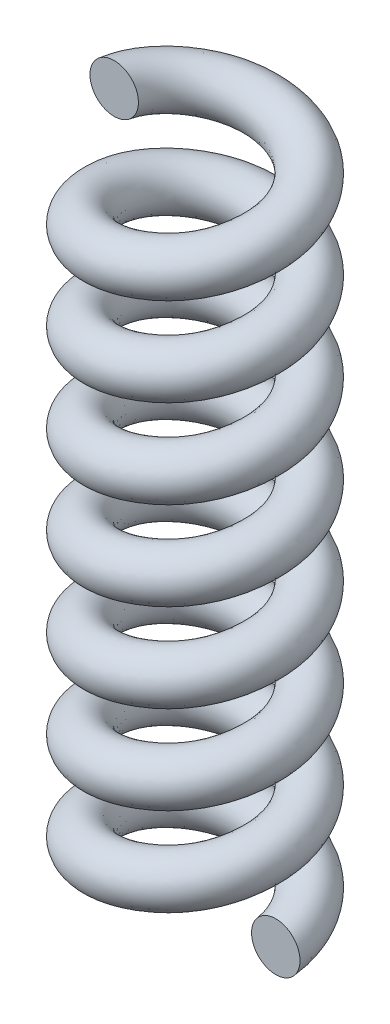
ISO-10303-21;
HEADER;
FILE_DESCRIPTION(('STEP AP214'),'2;1');
FILE_NAME('part.step','',(''),(''),'','','');
FILE_SCHEMA(('AUTOMOTIVE_DESIGN { 1 0 10303 214 1 1 1 1 }'));
ENDSEC;
DATA;
#1=APPLICATION_CONTEXT('core data for automotive mechanical design processes');
#2=APPLICATION_PROTOCOL_DEFINITION('international standard','automotive_design',2000,#1);
#3=PRODUCT_CONTEXT('',#1,'mechanical');
#4=PRODUCT('Part','Part','',(#3));
#5=PRODUCT_RELATED_PRODUCT_CATEGORY('part','',(#4));
#6=PRODUCT_DEFINITION_FORMATION('','',#4);
#7=PRODUCT_DEFINITION_CONTEXT('part definition',#1,'design');
#8=PRODUCT_DEFINITION('design','',#6,#7);
#9=PRODUCT_DEFINITION_SHAPE('','',#8);
#10=(LENGTH_UNIT() NAMED_UNIT(*) SI_UNIT(.MILLI.,.METRE.));
#11=(NAMED_UNIT(*) PLANE_ANGLE_UNIT() SI_UNIT($,.RADIAN.));
#12=(NAMED_UNIT(*) SI_UNIT($,.STERADIAN.) SOLID_ANGLE_UNIT());
#13=UNCERTAINTY_MEASURE_WITH_UNIT(LENGTH_MEASURE(1.E-05),#10,'distance_accuracy_value','');
#14=(GEOMETRIC_REPRESENTATION_CONTEXT(3) GLOBAL_UNCERTAINTY_ASSIGNED_CONTEXT((#13)) GLOBAL_UNIT_ASSIGNED_CONTEXT((#10,
#11,#12)) REPRESENTATION_CONTEXT('',''));
#15=CARTESIAN_POINT('',(0.,0.,0.));
#16=DIRECTION('',(0.,0.,1.));
#17=DIRECTION('',(1.,0.,0.));
#18=AXIS2_PLACEMENT_3D('',#15,#16,#17);
#19=CARTESIAN_POINT('',(-0.750000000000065,6.37500000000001,0.));
#20=DIRECTION('',(-1.01191787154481E-13,0.,-1.));
#21=DIRECTION('',(-1.,0.,1.01191787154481E-13));
#22=AXIS2_PLACEMENT_3D('',#19,#20,#21);
#23=PLANE('',#22);
#24=CARTESIAN_POINT('',(-0.750000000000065,6.37500000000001,0.));
#25=DIRECTION('',(-1.01191787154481E-13,0.,-1.));
#26=DIRECTION('',(-1.,0.,1.01191787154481E-13));
#27=AXIS2_PLACEMENT_3D('',#24,#25,#26);
#28=CIRCLE('',#27,0.225);
#29=CARTESIAN_POINT('',(-0.975000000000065,6.37500000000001,0.));
#30=VERTEX_POINT('',#29);
#31=EDGE_CURVE('E40',#30,#30,#28,.T.);
#32=ORIENTED_EDGE('',*,*,#31,.F.);
#33=EDGE_LOOP('',(#32));
#34=FACE_BOUND('',#33,.T.);
#35=ADVANCED_FACE('F32',(#34),#23,.F.);
#36=CARTESIAN_POINT('',(0.750000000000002,0.225000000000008,0.));
#37=DIRECTION('',(0.,0.,1.));
#38=DIRECTION('',(1.,0.,0.));
#39=AXIS2_PLACEMENT_3D('',#36,#37,#38);
#40=PLANE('',#39);
#41=CARTESIAN_POINT('',(0.750000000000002,0.225000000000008,0.));
#42=DIRECTION('',(0.,0.,1.));
#43=DIRECTION('',(1.,0.,0.));
#44=AXIS2_PLACEMENT_3D('',#41,#42,#43);
#45=CIRCLE('',#44,0.225);
#46=CARTESIAN_POINT('',(0.975000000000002,0.224999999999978,0.));
#47=VERTEX_POINT('',#46);
#48=EDGE_CURVE('E11',#47,#47,#45,.T.);
#49=ORIENTED_EDGE('',*,*,#48,.T.);
#50=EDGE_LOOP('',(#49));
#51=FACE_BOUND('',#50,.T.);
#52=ADVANCED_FACE('F48',(#51),#40,.T.);
#53=CARTESIAN_POINT('',(-0.975000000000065,6.37500000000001,0.));
#54=CARTESIAN_POINT('',(-0.975000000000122,6.30666666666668,-0.562916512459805));
#55=CARTESIAN_POINT('',(-0.487500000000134,6.23833333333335,-0.844374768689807));
#56=CARTESIAN_POINT('',(-1.46064691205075E-13,6.17000000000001,-1.12583302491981));
#57=CARTESIAN_POINT('',(0.487499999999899,6.10166666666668,-0.844374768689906));
#58=CARTESIAN_POINT('',(0.974999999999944,6.03333333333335,-0.562916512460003));
#59=CARTESIAN_POINT('',(0.975000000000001,5.96500000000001,0.));
#60=CARTESIAN_POINT('',(0.975000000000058,5.89666666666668,0.562916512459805));
#61=CARTESIAN_POINT('',(0.48750000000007,5.82833333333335,0.844374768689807));
#62=CARTESIAN_POINT('',(0.,5.76000000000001,1.12583302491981));
#63=CARTESIAN_POINT('',(-0.487499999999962,5.69166666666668,0.844374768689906));
#64=CARTESIAN_POINT('',(-0.975000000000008,5.62333333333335,0.562916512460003));
#65=CARTESIAN_POINT('',(-0.975000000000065,5.55500000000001,0.));
#66=CARTESIAN_POINT('',(-0.975000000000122,5.48666666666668,-0.562916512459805));
#67=CARTESIAN_POINT('',(-0.487500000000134,5.41833333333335,-0.844374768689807));
#68=CARTESIAN_POINT('',(-1.45977955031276E-13,5.35000000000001,-1.12583302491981));
#69=CARTESIAN_POINT('',(0.487499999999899,5.28166666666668,-0.844374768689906));
#70=CARTESIAN_POINT('',(0.974999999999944,5.21333333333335,-0.562916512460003));
#71=CARTESIAN_POINT('',(0.975000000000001,5.14500000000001,0.));
#72=CARTESIAN_POINT('',(0.975000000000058,5.07666666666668,0.562916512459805));
#73=CARTESIAN_POINT('',(0.48750000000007,5.00833333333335,0.844374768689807));
#74=CARTESIAN_POINT('',(0.,4.94000000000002,1.12583302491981));
#75=CARTESIAN_POINT('',(-0.487499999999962,4.87166666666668,0.844374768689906));
#76=CARTESIAN_POINT('',(-0.975000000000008,4.80333333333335,0.562916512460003));
#77=CARTESIAN_POINT('',(-0.975000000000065,4.73500000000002,0.));
#78=CARTESIAN_POINT('',(-0.975000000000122,4.66666666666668,-0.562916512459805));
#79=CARTESIAN_POINT('',(-0.487500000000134,4.59833333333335,-0.844374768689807));
#80=CARTESIAN_POINT('',(-1.45891218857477E-13,4.53000000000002,-1.12583302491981));
#81=CARTESIAN_POINT('',(0.487499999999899,4.46166666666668,-0.844374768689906));
#82=CARTESIAN_POINT('',(0.974999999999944,4.39333333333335,-0.562916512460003));
#83=CARTESIAN_POINT('',(0.975000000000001,4.32500000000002,0.));
#84=CARTESIAN_POINT('',(0.975000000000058,4.25666666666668,0.562916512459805));
#85=CARTESIAN_POINT('',(0.48750000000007,4.18833333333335,0.844374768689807));
#86=CARTESIAN_POINT('',(0.,4.12000000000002,1.12583302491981));
#87=CARTESIAN_POINT('',(-0.487499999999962,4.05166666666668,0.844374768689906));
#88=CARTESIAN_POINT('',(-0.975000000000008,3.98333333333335,0.562916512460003));
#89=CARTESIAN_POINT('',(-0.975000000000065,3.91500000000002,0.));
#90=CARTESIAN_POINT('',(-0.975000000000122,3.84666666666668,-0.562916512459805));
#91=CARTESIAN_POINT('',(-0.487500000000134,3.77833333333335,-0.844374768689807));
#92=CARTESIAN_POINT('',(-1.45804482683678E-13,3.71000000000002,-1.12583302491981));
#93=CARTESIAN_POINT('',(0.487499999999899,3.64166666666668,-0.844374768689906));
#94=CARTESIAN_POINT('',(0.974999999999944,3.57333333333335,-0.562916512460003));
#95=CARTESIAN_POINT('',(0.975000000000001,3.50500000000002,0.));
#96=CARTESIAN_POINT('',(0.975000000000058,3.43666666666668,0.562916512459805));
#97=CARTESIAN_POINT('',(0.487500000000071,3.36833333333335,0.844374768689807));
#98=CARTESIAN_POINT('',(0.,3.30000000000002,1.12583302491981));
#99=CARTESIAN_POINT('',(-0.487499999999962,3.23166666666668,0.844374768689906));
#100=CARTESIAN_POINT('',(-0.975000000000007,3.16333333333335,0.562916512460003));
#101=CARTESIAN_POINT('',(-0.975000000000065,3.09500000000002,0.));
#102=CARTESIAN_POINT('',(-0.975000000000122,3.02666666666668,-0.562916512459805));
#103=CARTESIAN_POINT('',(-0.487500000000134,2.95833333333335,-0.844374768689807));
#104=CARTESIAN_POINT('',(-1.4571774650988E-13,2.89000000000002,-1.12583302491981));
#105=CARTESIAN_POINT('',(0.487499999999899,2.82166666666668,-0.844374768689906));
#106=CARTESIAN_POINT('',(0.974999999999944,2.75333333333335,-0.562916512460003));
#107=CARTESIAN_POINT('',(0.975000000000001,2.68500000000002,0.));
#108=CARTESIAN_POINT('',(0.975000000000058,2.61666666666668,0.562916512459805));
#109=CARTESIAN_POINT('',(0.487500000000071,2.54833333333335,0.844374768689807));
#110=CARTESIAN_POINT('',(0.,2.48000000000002,1.12583302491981));
#111=CARTESIAN_POINT('',(-0.487499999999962,2.41166666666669,0.844374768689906));
#112=CARTESIAN_POINT('',(-0.975000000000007,2.34333333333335,0.562916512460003));
#113=CARTESIAN_POINT('',(-0.975000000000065,2.27500000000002,0.));
#114=CARTESIAN_POINT('',(-0.975000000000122,2.20666666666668,-0.562916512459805));
#115=CARTESIAN_POINT('',(-0.487500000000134,2.13833333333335,-0.844374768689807));
#116=CARTESIAN_POINT('',(-1.45631010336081E-13,2.07000000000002,-1.12583302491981));
#117=CARTESIAN_POINT('',(0.487499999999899,2.00166666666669,-0.844374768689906));
#118=CARTESIAN_POINT('',(0.974999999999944,1.93333333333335,-0.562916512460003));
#119=CARTESIAN_POINT('',(0.975000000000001,1.86500000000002,0.));
#120=CARTESIAN_POINT('',(0.975000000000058,1.79666666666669,0.562916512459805));
#121=CARTESIAN_POINT('',(0.487500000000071,1.72833333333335,0.844374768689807));
#122=CARTESIAN_POINT('',(0.,1.66000000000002,1.12583302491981));
#123=CARTESIAN_POINT('',(-0.487499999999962,1.59166666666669,0.844374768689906));
#124=CARTESIAN_POINT('',(-0.975000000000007,1.52333333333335,0.562916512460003));
#125=CARTESIAN_POINT('',(-0.975000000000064,1.45500000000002,0.));
#126=CARTESIAN_POINT('',(-0.975000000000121,1.38666666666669,-0.562916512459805));
#127=CARTESIAN_POINT('',(-0.487500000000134,1.31833333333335,-0.844374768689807));
#128=CARTESIAN_POINT('',(-1.45544274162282E-13,1.25000000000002,-1.12583302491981));
#129=CARTESIAN_POINT('',(0.487499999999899,1.18166666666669,-0.844374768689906));
#130=CARTESIAN_POINT('',(0.974999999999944,1.11333333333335,-0.562916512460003));
#131=CARTESIAN_POINT('',(0.975000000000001,1.04500000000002,0.));
#132=CARTESIAN_POINT('',(0.975000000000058,0.976666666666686,0.562916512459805));
#133=CARTESIAN_POINT('',(0.487500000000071,0.908333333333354,0.844374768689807));
#134=CARTESIAN_POINT('',(0.,0.84000000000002,1.12583302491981));
#135=CARTESIAN_POINT('',(-0.487499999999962,0.771666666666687,0.844374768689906));
#136=CARTESIAN_POINT('',(-0.975000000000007,0.703333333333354,0.562916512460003));
#137=CARTESIAN_POINT('',(-0.975000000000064,0.63500000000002,0.));
#138=CARTESIAN_POINT('',(-0.975000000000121,0.566666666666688,-0.562916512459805));
#139=CARTESIAN_POINT('',(-0.487500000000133,0.498333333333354,-0.844374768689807));
#140=CARTESIAN_POINT('',(-1.45457537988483E-13,0.430000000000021,-1.12583302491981));
#141=CARTESIAN_POINT('',(0.487499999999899,0.361666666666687,-0.844374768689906));
#142=CARTESIAN_POINT('',(0.974999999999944,0.293333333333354,-0.562916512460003));
#143=CARTESIAN_POINT('',(0.975000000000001,0.225000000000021,0.));
#144=CARTESIAN_POINT('',(0.975000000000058,0.156666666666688,0.562916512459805));
#145=CARTESIAN_POINT('',(0.487500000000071,0.0883333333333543,0.844374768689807));
#146=CARTESIAN_POINT('',(0.,0.0200000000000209,1.12583302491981));
#147=CARTESIAN_POINT('',(-0.487499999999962,-0.0483333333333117,0.844374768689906));
#148=CARTESIAN_POINT('',(-0.975000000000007,-0.116666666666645,0.562916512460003));
#149=CARTESIAN_POINT('',(-0.975000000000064,-0.184999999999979,0.));
#150=CARTESIAN_POINT('',(-0.975000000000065,6.82500000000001,0.));
#151=CARTESIAN_POINT('',(-0.975000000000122,6.75666666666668,-0.562916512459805));
#152=CARTESIAN_POINT('',(-0.487500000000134,6.68833333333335,-0.844374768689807));
#153=CARTESIAN_POINT('',(-1.46112290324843E-13,6.62000000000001,-1.12583302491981));
#154=CARTESIAN_POINT('',(0.487499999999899,6.55166666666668,-0.844374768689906));
#155=CARTESIAN_POINT('',(0.974999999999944,6.48333333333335,-0.562916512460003));
#156=CARTESIAN_POINT('',(0.975000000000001,6.41500000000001,0.));
#157=CARTESIAN_POINT('',(0.975000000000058,6.34666666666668,0.562916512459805));
#158=CARTESIAN_POINT('',(0.48750000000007,6.27833333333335,0.844374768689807));
#159=CARTESIAN_POINT('',(0.,6.21000000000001,1.12583302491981));
#160=CARTESIAN_POINT('',(-0.487499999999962,6.14166666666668,0.844374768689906));
#161=CARTESIAN_POINT('',(-0.975000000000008,6.07333333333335,0.562916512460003));
#162=CARTESIAN_POINT('',(-0.975000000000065,6.00500000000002,0.));
#163=CARTESIAN_POINT('',(-0.975000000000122,5.93666666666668,-0.562916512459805));
#164=CARTESIAN_POINT('',(-0.487500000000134,5.86833333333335,-0.844374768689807));
#165=CARTESIAN_POINT('',(-1.46025554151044E-13,5.80000000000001,-1.12583302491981));
#166=CARTESIAN_POINT('',(0.487499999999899,5.73166666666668,-0.844374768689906));
#167=CARTESIAN_POINT('',(0.974999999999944,5.66333333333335,-0.562916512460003));
#168=CARTESIAN_POINT('',(0.975000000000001,5.59500000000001,0.));
#169=CARTESIAN_POINT('',(0.975000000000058,5.52666666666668,0.562916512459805));
#170=CARTESIAN_POINT('',(0.48750000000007,5.45833333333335,0.844374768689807));
#171=CARTESIAN_POINT('',(0.,5.39000000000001,1.12583302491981));
#172=CARTESIAN_POINT('',(-0.487499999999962,5.32166666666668,0.844374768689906));
#173=CARTESIAN_POINT('',(-0.975000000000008,5.25333333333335,0.562916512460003));
#174=CARTESIAN_POINT('',(-0.975000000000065,5.18500000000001,0.));
#175=CARTESIAN_POINT('',(-0.975000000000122,5.11666666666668,-0.562916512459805));
#176=CARTESIAN_POINT('',(-0.487500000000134,5.04833333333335,-0.844374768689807));
#177=CARTESIAN_POINT('',(-1.45938817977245E-13,4.98000000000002,-1.12583302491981));
#178=CARTESIAN_POINT('',(0.487499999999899,4.91166666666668,-0.844374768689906));
#179=CARTESIAN_POINT('',(0.974999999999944,4.84333333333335,-0.562916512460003));
#180=CARTESIAN_POINT('',(0.975000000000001,4.77500000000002,0.));
#181=CARTESIAN_POINT('',(0.975000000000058,4.70666666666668,0.562916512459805));
#182=CARTESIAN_POINT('',(0.48750000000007,4.63833333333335,0.844374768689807));
#183=CARTESIAN_POINT('',(0.,4.57000000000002,1.12583302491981));
#184=CARTESIAN_POINT('',(-0.487499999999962,4.50166666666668,0.844374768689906));
#185=CARTESIAN_POINT('',(-0.975000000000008,4.43333333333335,0.562916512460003));
#186=CARTESIAN_POINT('',(-0.975000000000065,4.36500000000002,0.));
#187=CARTESIAN_POINT('',(-0.975000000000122,4.29666666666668,-0.562916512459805));
#188=CARTESIAN_POINT('',(-0.487500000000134,4.22833333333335,-0.844374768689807));
#189=CARTESIAN_POINT('',(-1.45852081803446E-13,4.16000000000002,-1.12583302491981));
#190=CARTESIAN_POINT('',(0.487499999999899,4.09166666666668,-0.844374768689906));
#191=CARTESIAN_POINT('',(0.974999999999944,4.02333333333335,-0.562916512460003));
#192=CARTESIAN_POINT('',(0.975000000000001,3.95500000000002,0.));
#193=CARTESIAN_POINT('',(0.975000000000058,3.88666666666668,0.562916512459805));
#194=CARTESIAN_POINT('',(0.48750000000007,3.81833333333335,0.844374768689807));
#195=CARTESIAN_POINT('',(0.,3.75000000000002,1.12583302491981));
#196=CARTESIAN_POINT('',(-0.487499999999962,3.68166666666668,0.844374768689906));
#197=CARTESIAN_POINT('',(-0.975000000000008,3.61333333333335,0.562916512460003));
#198=CARTESIAN_POINT('',(-0.975000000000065,3.54500000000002,0.));
#199=CARTESIAN_POINT('',(-0.975000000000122,3.47666666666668,-0.562916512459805));
#200=CARTESIAN_POINT('',(-0.487500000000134,3.40833333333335,-0.844374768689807));
#201=CARTESIAN_POINT('',(-1.45765345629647E-13,3.34000000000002,-1.12583302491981));
#202=CARTESIAN_POINT('',(0.487499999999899,3.27166666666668,-0.844374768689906));
#203=CARTESIAN_POINT('',(0.974999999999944,3.20333333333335,-0.562916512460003));
#204=CARTESIAN_POINT('',(0.975000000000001,3.13500000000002,0.));
#205=CARTESIAN_POINT('',(0.975000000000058,3.06666666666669,0.562916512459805));
#206=CARTESIAN_POINT('',(0.487500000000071,2.99833333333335,0.844374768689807));
#207=CARTESIAN_POINT('',(0.,2.93000000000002,1.12583302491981));
#208=CARTESIAN_POINT('',(-0.487499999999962,2.86166666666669,0.844374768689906));
#209=CARTESIAN_POINT('',(-0.975000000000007,2.79333333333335,0.562916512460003));
#210=CARTESIAN_POINT('',(-0.975000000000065,2.72500000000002,0.));
#211=CARTESIAN_POINT('',(-0.975000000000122,2.65666666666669,-0.562916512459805));
#212=CARTESIAN_POINT('',(-0.487500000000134,2.58833333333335,-0.844374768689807));
#213=CARTESIAN_POINT('',(-1.45678609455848E-13,2.52000000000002,-1.12583302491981));
#214=CARTESIAN_POINT('',(0.487499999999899,2.45166666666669,-0.844374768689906));
#215=CARTESIAN_POINT('',(0.974999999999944,2.38333333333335,-0.562916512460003));
#216=CARTESIAN_POINT('',(0.975000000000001,2.31500000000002,0.));
#217=CARTESIAN_POINT('',(0.975000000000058,2.24666666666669,0.562916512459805));
#218=CARTESIAN_POINT('',(0.487500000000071,2.17833333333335,0.844374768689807));
#219=CARTESIAN_POINT('',(0.,2.11000000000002,1.12583302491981));
#220=CARTESIAN_POINT('',(-0.487499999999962,2.04166666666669,0.844374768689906));
#221=CARTESIAN_POINT('',(-0.975000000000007,1.97333333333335,0.562916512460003));
#222=CARTESIAN_POINT('',(-0.975000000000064,1.90500000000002,0.));
#223=CARTESIAN_POINT('',(-0.975000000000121,1.83666666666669,-0.562916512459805));
#224=CARTESIAN_POINT('',(-0.487500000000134,1.76833333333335,-0.844374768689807));
#225=CARTESIAN_POINT('',(-1.4559187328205E-13,1.70000000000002,-1.12583302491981));
#226=CARTESIAN_POINT('',(0.487499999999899,1.63166666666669,-0.844374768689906));
#227=CARTESIAN_POINT('',(0.974999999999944,1.56333333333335,-0.562916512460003));
#228=CARTESIAN_POINT('',(0.975000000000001,1.49500000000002,0.));
#229=CARTESIAN_POINT('',(0.975000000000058,1.42666666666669,0.562916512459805));
#230=CARTESIAN_POINT('',(0.487500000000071,1.35833333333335,0.844374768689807));
#231=CARTESIAN_POINT('',(0.,1.29000000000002,1.12583302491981));
#232=CARTESIAN_POINT('',(-0.487499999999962,1.22166666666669,0.844374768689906));
#233=CARTESIAN_POINT('',(-0.975000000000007,1.15333333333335,0.562916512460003));
#234=CARTESIAN_POINT('',(-0.975000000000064,1.08500000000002,0.));
#235=CARTESIAN_POINT('',(-0.975000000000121,1.01666666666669,-0.562916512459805));
#236=CARTESIAN_POINT('',(-0.487500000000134,0.948333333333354,-0.844374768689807));
#237=CARTESIAN_POINT('',(-1.45505137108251E-13,0.880000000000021,-1.12583302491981));
#238=CARTESIAN_POINT('',(0.487499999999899,0.811666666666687,-0.844374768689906));
#239=CARTESIAN_POINT('',(0.974999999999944,0.743333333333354,-0.562916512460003));
#240=CARTESIAN_POINT('',(0.975000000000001,0.675000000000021,0.));
#241=CARTESIAN_POINT('',(0.975000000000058,0.606666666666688,0.562916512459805));
#242=CARTESIAN_POINT('',(0.487500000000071,0.538333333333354,0.844374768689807));
#243=CARTESIAN_POINT('',(0.,0.470000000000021,1.12583302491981));
#244=CARTESIAN_POINT('',(-0.487499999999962,0.401666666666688,0.844374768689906));
#245=CARTESIAN_POINT('',(-0.975000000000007,0.333333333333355,0.562916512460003));
#246=CARTESIAN_POINT('',(-0.975000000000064,0.265000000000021,0.));
#247=CARTESIAN_POINT('',(-0.525000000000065,6.82500000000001,0.));
#248=CARTESIAN_POINT('',(-0.525000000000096,6.75666666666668,-0.303108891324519));
#249=CARTESIAN_POINT('',(-0.262500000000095,6.68833333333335,-0.454663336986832));
#250=CARTESIAN_POINT('',(0.,6.62000000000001,-0.606217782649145));
#251=CARTESIAN_POINT('',(0.262499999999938,6.55166666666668,-0.454663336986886));
#252=CARTESIAN_POINT('',(0.52499999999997,6.48333333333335,-0.303108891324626));
#253=CARTESIAN_POINT('',(0.525000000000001,6.41500000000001,0.));
#254=CARTESIAN_POINT('',(0.525000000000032,6.34666666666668,0.303108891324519));
#255=CARTESIAN_POINT('',(0.262500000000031,6.27833333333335,0.454663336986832));
#256=CARTESIAN_POINT('',(0.,6.21000000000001,0.606217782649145));
#257=CARTESIAN_POINT('',(-0.262500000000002,6.14166666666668,0.454663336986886));
#258=CARTESIAN_POINT('',(-0.525000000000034,6.07333333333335,0.303108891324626));
#259=CARTESIAN_POINT('',(-0.525000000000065,6.00500000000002,0.));
#260=CARTESIAN_POINT('',(-0.525000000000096,5.93666666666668,-0.303108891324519));
#261=CARTESIAN_POINT('',(-0.262500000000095,5.86833333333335,-0.454663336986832));
#262=CARTESIAN_POINT('',(0.,5.80000000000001,-0.606217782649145));
#263=CARTESIAN_POINT('',(0.262499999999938,5.73166666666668,-0.454663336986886));
#264=CARTESIAN_POINT('',(0.52499999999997,5.66333333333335,-0.303108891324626));
#265=CARTESIAN_POINT('',(0.525000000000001,5.59500000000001,0.));
#266=CARTESIAN_POINT('',(0.525000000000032,5.52666666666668,0.303108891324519));
#267=CARTESIAN_POINT('',(0.262500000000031,5.45833333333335,0.454663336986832));
#268=CARTESIAN_POINT('',(0.,5.39000000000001,0.606217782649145));
#269=CARTESIAN_POINT('',(-0.262500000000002,5.32166666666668,0.454663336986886));
#270=CARTESIAN_POINT('',(-0.525000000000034,5.25333333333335,0.303108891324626));
#271=CARTESIAN_POINT('',(-0.525000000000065,5.18500000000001,0.));
#272=CARTESIAN_POINT('',(-0.525000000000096,5.11666666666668,-0.303108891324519));
#273=CARTESIAN_POINT('',(-0.262500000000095,5.04833333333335,-0.454663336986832));
#274=CARTESIAN_POINT('',(0.,4.98000000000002,-0.606217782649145));
#275=CARTESIAN_POINT('',(0.262499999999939,4.91166666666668,-0.454663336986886));
#276=CARTESIAN_POINT('',(0.52499999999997,4.84333333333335,-0.303108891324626));
#277=CARTESIAN_POINT('',(0.525000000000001,4.77500000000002,0.));
#278=CARTESIAN_POINT('',(0.525000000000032,4.70666666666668,0.303108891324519));
#279=CARTESIAN_POINT('',(0.262500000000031,4.63833333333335,0.454663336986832));
#280=CARTESIAN_POINT('',(0.,4.57000000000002,0.606217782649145));
#281=CARTESIAN_POINT('',(-0.262500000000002,4.50166666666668,0.454663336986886));
#282=CARTESIAN_POINT('',(-0.525000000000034,4.43333333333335,0.303108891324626));
#283=CARTESIAN_POINT('',(-0.525000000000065,4.36500000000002,0.));
#284=CARTESIAN_POINT('',(-0.525000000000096,4.29666666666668,-0.303108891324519));
#285=CARTESIAN_POINT('',(-0.262500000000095,4.22833333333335,-0.454663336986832));
#286=CARTESIAN_POINT('',(0.,4.16000000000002,-0.606217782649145));
#287=CARTESIAN_POINT('',(0.262499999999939,4.09166666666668,-0.454663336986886));
#288=CARTESIAN_POINT('',(0.52499999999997,4.02333333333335,-0.303108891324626));
#289=CARTESIAN_POINT('',(0.525000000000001,3.95500000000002,0.));
#290=CARTESIAN_POINT('',(0.525000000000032,3.88666666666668,0.303108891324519));
#291=CARTESIAN_POINT('',(0.262500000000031,3.81833333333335,0.454663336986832));
#292=CARTESIAN_POINT('',(0.,3.75000000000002,0.606217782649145));
#293=CARTESIAN_POINT('',(-0.262500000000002,3.68166666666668,0.454663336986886));
#294=CARTESIAN_POINT('',(-0.525000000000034,3.61333333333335,0.303108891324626));
#295=CARTESIAN_POINT('',(-0.525000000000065,3.54500000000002,0.));
#296=CARTESIAN_POINT('',(-0.525000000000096,3.47666666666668,-0.303108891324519));
#297=CARTESIAN_POINT('',(-0.262500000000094,3.40833333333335,-0.454663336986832));
#298=CARTESIAN_POINT('',(0.,3.34000000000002,-0.606217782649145));
#299=CARTESIAN_POINT('',(0.262499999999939,3.27166666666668,-0.454663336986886));
#300=CARTESIAN_POINT('',(0.524999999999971,3.20333333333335,-0.303108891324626));
#301=CARTESIAN_POINT('',(0.525000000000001,3.13500000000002,0.));
#302=CARTESIAN_POINT('',(0.525000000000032,3.06666666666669,0.303108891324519));
#303=CARTESIAN_POINT('',(0.262500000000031,2.99833333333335,0.454663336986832));
#304=CARTESIAN_POINT('',(0.,2.93000000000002,0.606217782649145));
#305=CARTESIAN_POINT('',(-0.262500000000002,2.86166666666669,0.454663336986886));
#306=CARTESIAN_POINT('',(-0.525000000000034,2.79333333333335,0.303108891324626));
#307=CARTESIAN_POINT('',(-0.525000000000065,2.72500000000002,0.));
#308=CARTESIAN_POINT('',(-0.525000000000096,2.65666666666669,-0.303108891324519));
#309=CARTESIAN_POINT('',(-0.262500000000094,2.58833333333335,-0.454663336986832));
#310=CARTESIAN_POINT('',(0.,2.52000000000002,-0.606217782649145));
#311=CARTESIAN_POINT('',(0.262499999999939,2.45166666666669,-0.454663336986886));
#312=CARTESIAN_POINT('',(0.524999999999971,2.38333333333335,-0.303108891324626));
#313=CARTESIAN_POINT('',(0.525000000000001,2.31500000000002,0.));
#314=CARTESIAN_POINT('',(0.525000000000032,2.24666666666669,0.303108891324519));
#315=CARTESIAN_POINT('',(0.262500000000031,2.17833333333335,0.454663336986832));
#316=CARTESIAN_POINT('',(0.,2.11000000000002,0.606217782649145));
#317=CARTESIAN_POINT('',(-0.262500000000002,2.04166666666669,0.454663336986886));
#318=CARTESIAN_POINT('',(-0.525000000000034,1.97333333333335,0.303108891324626));
#319=CARTESIAN_POINT('',(-0.525000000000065,1.90500000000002,0.));
#320=CARTESIAN_POINT('',(-0.525000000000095,1.83666666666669,-0.303108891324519));
#321=CARTESIAN_POINT('',(-0.262500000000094,1.76833333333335,-0.454663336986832));
#322=CARTESIAN_POINT('',(0.,1.70000000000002,-0.606217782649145));
#323=CARTESIAN_POINT('',(0.262499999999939,1.63166666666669,-0.454663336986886));
#324=CARTESIAN_POINT('',(0.524999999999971,1.56333333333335,-0.303108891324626));
#325=CARTESIAN_POINT('',(0.525000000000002,1.49500000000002,0.));
#326=CARTESIAN_POINT('',(0.525000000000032,1.42666666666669,0.303108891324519));
#327=CARTESIAN_POINT('',(0.262500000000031,1.35833333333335,0.454663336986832));
#328=CARTESIAN_POINT('',(0.,1.29000000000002,0.606217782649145));
#329=CARTESIAN_POINT('',(-0.262500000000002,1.22166666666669,0.454663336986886));
#330=CARTESIAN_POINT('',(-0.525000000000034,1.15333333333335,0.303108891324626));
#331=CARTESIAN_POINT('',(-0.525000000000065,1.08500000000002,0.));
#332=CARTESIAN_POINT('',(-0.525000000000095,1.01666666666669,-0.303108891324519));
#333=CARTESIAN_POINT('',(-0.262500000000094,0.948333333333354,-0.454663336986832));
#334=CARTESIAN_POINT('',(0.,0.880000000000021,-0.606217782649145));
#335=CARTESIAN_POINT('',(0.262499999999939,0.811666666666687,-0.454663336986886));
#336=CARTESIAN_POINT('',(0.524999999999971,0.743333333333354,-0.303108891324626));
#337=CARTESIAN_POINT('',(0.525000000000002,0.675000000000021,0.));
#338=CARTESIAN_POINT('',(0.525000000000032,0.606666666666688,0.303108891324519));
#339=CARTESIAN_POINT('',(0.262500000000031,0.538333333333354,0.454663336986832));
#340=CARTESIAN_POINT('',(0.,0.470000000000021,0.606217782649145));
#341=CARTESIAN_POINT('',(-0.262500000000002,0.401666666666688,0.454663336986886));
#342=CARTESIAN_POINT('',(-0.525000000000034,0.333333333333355,0.303108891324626));
#343=CARTESIAN_POINT('',(-0.525000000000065,0.265000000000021,0.));
#344=CARTESIAN_POINT('',(-0.525000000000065,6.37500000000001,0.));
#345=CARTESIAN_POINT('',(-0.525000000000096,6.30666666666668,-0.303108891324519));
#346=CARTESIAN_POINT('',(-0.262500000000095,6.23833333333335,-0.454663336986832));
#347=CARTESIAN_POINT('',(0.,6.17000000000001,-0.606217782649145));
#348=CARTESIAN_POINT('',(0.262499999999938,6.10166666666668,-0.454663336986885));
#349=CARTESIAN_POINT('',(0.52499999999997,6.03333333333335,-0.303108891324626));
#350=CARTESIAN_POINT('',(0.525000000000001,5.96500000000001,0.));
#351=CARTESIAN_POINT('',(0.525000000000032,5.89666666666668,0.303108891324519));
#352=CARTESIAN_POINT('',(0.262500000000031,5.82833333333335,0.454663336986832));
#353=CARTESIAN_POINT('',(0.,5.76000000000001,0.606217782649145));
#354=CARTESIAN_POINT('',(-0.262500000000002,5.69166666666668,0.454663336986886));
#355=CARTESIAN_POINT('',(-0.525000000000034,5.62333333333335,0.303108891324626));
#356=CARTESIAN_POINT('',(-0.525000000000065,5.55500000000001,0.));
#357=CARTESIAN_POINT('',(-0.525000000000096,5.48666666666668,-0.303108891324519));
#358=CARTESIAN_POINT('',(-0.262500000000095,5.41833333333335,-0.454663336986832));
#359=CARTESIAN_POINT('',(0.,5.35000000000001,-0.606217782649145));
#360=CARTESIAN_POINT('',(0.262499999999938,5.28166666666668,-0.454663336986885));
#361=CARTESIAN_POINT('',(0.52499999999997,5.21333333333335,-0.303108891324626));
#362=CARTESIAN_POINT('',(0.525000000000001,5.14500000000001,0.));
#363=CARTESIAN_POINT('',(0.525000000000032,5.07666666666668,0.303108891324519));
#364=CARTESIAN_POINT('',(0.262500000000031,5.00833333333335,0.454663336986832));
#365=CARTESIAN_POINT('',(0.,4.94000000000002,0.606217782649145));
#366=CARTESIAN_POINT('',(-0.262500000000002,4.87166666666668,0.454663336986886));
#367=CARTESIAN_POINT('',(-0.525000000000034,4.80333333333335,0.303108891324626));
#368=CARTESIAN_POINT('',(-0.525000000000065,4.73500000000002,0.));
#369=CARTESIAN_POINT('',(-0.525000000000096,4.66666666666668,-0.303108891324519));
#370=CARTESIAN_POINT('',(-0.262500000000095,4.59833333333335,-0.454663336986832));
#371=CARTESIAN_POINT('',(0.,4.53000000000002,-0.606217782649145));
#372=CARTESIAN_POINT('',(0.262499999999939,4.46166666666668,-0.454663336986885));
#373=CARTESIAN_POINT('',(0.52499999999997,4.39333333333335,-0.303108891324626));
#374=CARTESIAN_POINT('',(0.525000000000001,4.32500000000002,0.));
#375=CARTESIAN_POINT('',(0.525000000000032,4.25666666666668,0.303108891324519));
#376=CARTESIAN_POINT('',(0.262500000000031,4.18833333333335,0.454663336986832));
#377=CARTESIAN_POINT('',(0.,4.12000000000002,0.606217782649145));
#378=CARTESIAN_POINT('',(-0.262500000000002,4.05166666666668,0.454663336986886));
#379=CARTESIAN_POINT('',(-0.525000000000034,3.98333333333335,0.303108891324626));
#380=CARTESIAN_POINT('',(-0.525000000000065,3.91500000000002,0.));
#381=CARTESIAN_POINT('',(-0.525000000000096,3.84666666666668,-0.303108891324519));
#382=CARTESIAN_POINT('',(-0.262500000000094,3.77833333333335,-0.454663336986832));
#383=CARTESIAN_POINT('',(0.,3.71000000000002,-0.606217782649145));
#384=CARTESIAN_POINT('',(0.262499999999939,3.64166666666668,-0.454663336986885));
#385=CARTESIAN_POINT('',(0.52499999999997,3.57333333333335,-0.303108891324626));
#386=CARTESIAN_POINT('',(0.525000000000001,3.50500000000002,0.));
#387=CARTESIAN_POINT('',(0.525000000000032,3.43666666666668,0.303108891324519));
#388=CARTESIAN_POINT('',(0.262500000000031,3.36833333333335,0.454663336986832));
#389=CARTESIAN_POINT('',(0.,3.30000000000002,0.606217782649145));
#390=CARTESIAN_POINT('',(-0.262500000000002,3.23166666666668,0.454663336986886));
#391=CARTESIAN_POINT('',(-0.525000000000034,3.16333333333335,0.303108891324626));
#392=CARTESIAN_POINT('',(-0.525000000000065,3.09500000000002,0.));
#393=CARTESIAN_POINT('',(-0.525000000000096,3.02666666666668,-0.303108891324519));
#394=CARTESIAN_POINT('',(-0.262500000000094,2.95833333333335,-0.454663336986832));
#395=CARTESIAN_POINT('',(0.,2.89000000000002,-0.606217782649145));
#396=CARTESIAN_POINT('',(0.262499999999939,2.82166666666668,-0.454663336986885));
#397=CARTESIAN_POINT('',(0.52499999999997,2.75333333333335,-0.303108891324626));
#398=CARTESIAN_POINT('',(0.525000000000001,2.68500000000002,0.));
#399=CARTESIAN_POINT('',(0.525000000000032,2.61666666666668,0.303108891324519));
#400=CARTESIAN_POINT('',(0.262500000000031,2.54833333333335,0.454663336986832));
#401=CARTESIAN_POINT('',(0.,2.48000000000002,0.606217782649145));
#402=CARTESIAN_POINT('',(-0.262500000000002,2.41166666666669,0.454663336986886));
#403=CARTESIAN_POINT('',(-0.525000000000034,2.34333333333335,0.303108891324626));
#404=CARTESIAN_POINT('',(-0.525000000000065,2.27500000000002,0.));
#405=CARTESIAN_POINT('',(-0.525000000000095,2.20666666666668,-0.303108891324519));
#406=CARTESIAN_POINT('',(-0.262500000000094,2.13833333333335,-0.454663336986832));
#407=CARTESIAN_POINT('',(0.,2.07000000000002,-0.606217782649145));
#408=CARTESIAN_POINT('',(0.262499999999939,2.00166666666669,-0.454663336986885));
#409=CARTESIAN_POINT('',(0.52499999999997,1.93333333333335,-0.303108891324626));
#410=CARTESIAN_POINT('',(0.525000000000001,1.86500000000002,0.));
#411=CARTESIAN_POINT('',(0.525000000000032,1.79666666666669,0.303108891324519));
#412=CARTESIAN_POINT('',(0.262500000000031,1.72833333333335,0.454663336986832));
#413=CARTESIAN_POINT('',(0.,1.66000000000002,0.606217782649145));
#414=CARTESIAN_POINT('',(-0.262500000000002,1.59166666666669,0.454663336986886));
#415=CARTESIAN_POINT('',(-0.525000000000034,1.52333333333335,0.303108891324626));
#416=CARTESIAN_POINT('',(-0.525000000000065,1.45500000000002,0.));
#417=CARTESIAN_POINT('',(-0.525000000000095,1.38666666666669,-0.303108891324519));
#418=CARTESIAN_POINT('',(-0.262500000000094,1.31833333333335,-0.454663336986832));
#419=CARTESIAN_POINT('',(0.,1.25000000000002,-0.606217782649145));
#420=CARTESIAN_POINT('',(0.262499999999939,1.18166666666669,-0.454663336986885));
#421=CARTESIAN_POINT('',(0.524999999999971,1.11333333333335,-0.303108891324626));
#422=CARTESIAN_POINT('',(0.525000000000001,1.04500000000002,0.));
#423=CARTESIAN_POINT('',(0.525000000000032,0.976666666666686,0.303108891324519));
#424=CARTESIAN_POINT('',(0.262500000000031,0.908333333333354,0.454663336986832));
#425=CARTESIAN_POINT('',(0.,0.84000000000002,0.606217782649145));
#426=CARTESIAN_POINT('',(-0.262500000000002,0.771666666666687,0.454663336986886));
#427=CARTESIAN_POINT('',(-0.525000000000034,0.703333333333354,0.303108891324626));
#428=CARTESIAN_POINT('',(-0.525000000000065,0.63500000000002,0.));
#429=CARTESIAN_POINT('',(-0.525000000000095,0.566666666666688,-0.303108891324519));
#430=CARTESIAN_POINT('',(-0.262500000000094,0.498333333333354,-0.454663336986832));
#431=CARTESIAN_POINT('',(0.,0.430000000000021,-0.606217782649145));
#432=CARTESIAN_POINT('',(0.262499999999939,0.361666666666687,-0.454663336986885));
#433=CARTESIAN_POINT('',(0.524999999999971,0.293333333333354,-0.303108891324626));
#434=CARTESIAN_POINT('',(0.525000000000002,0.225000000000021,0.));
#435=CARTESIAN_POINT('',(0.525000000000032,0.156666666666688,0.303108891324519));
#436=CARTESIAN_POINT('',(0.262500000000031,0.0883333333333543,0.454663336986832));
#437=CARTESIAN_POINT('',(0.,0.0200000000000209,0.606217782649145));
#438=CARTESIAN_POINT('',(-0.262500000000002,-0.0483333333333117,0.454663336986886));
#439=CARTESIAN_POINT('',(-0.525000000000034,-0.116666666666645,0.303108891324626));
#440=CARTESIAN_POINT('',(-0.525000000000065,-0.184999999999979,0.));
#441=CARTESIAN_POINT('',(-0.525000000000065,5.92500000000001,0.));
#442=CARTESIAN_POINT('',(-0.525000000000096,5.85666666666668,-0.303108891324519));
#443=CARTESIAN_POINT('',(-0.262500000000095,5.78833333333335,-0.454663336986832));
#444=CARTESIAN_POINT('',(0.,5.72000000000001,-0.606217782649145));
#445=CARTESIAN_POINT('',(0.262499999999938,5.65166666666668,-0.454663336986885));
#446=CARTESIAN_POINT('',(0.52499999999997,5.58333333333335,-0.303108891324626));
#447=CARTESIAN_POINT('',(0.525000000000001,5.51500000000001,0.));
#448=CARTESIAN_POINT('',(0.525000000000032,5.44666666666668,0.303108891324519));
#449=CARTESIAN_POINT('',(0.262500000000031,5.37833333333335,0.454663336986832));
#450=CARTESIAN_POINT('',(0.,5.31000000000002,0.606217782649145));
#451=CARTESIAN_POINT('',(-0.262500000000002,5.24166666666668,0.454663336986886));
#452=CARTESIAN_POINT('',(-0.525000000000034,5.17333333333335,0.303108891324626));
#453=CARTESIAN_POINT('',(-0.525000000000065,5.10500000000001,0.));
#454=CARTESIAN_POINT('',(-0.525000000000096,5.03666666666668,-0.303108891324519));
#455=CARTESIAN_POINT('',(-0.262500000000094,4.96833333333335,-0.454663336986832));
#456=CARTESIAN_POINT('',(0.,4.90000000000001,-0.606217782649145));
#457=CARTESIAN_POINT('',(0.262499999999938,4.83166666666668,-0.454663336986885));
#458=CARTESIAN_POINT('',(0.52499999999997,4.76333333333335,-0.303108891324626));
#459=CARTESIAN_POINT('',(0.525000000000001,4.69500000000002,0.));
#460=CARTESIAN_POINT('',(0.525000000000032,4.62666666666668,0.303108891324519));
#461=CARTESIAN_POINT('',(0.262500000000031,4.55833333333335,0.454663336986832));
#462=CARTESIAN_POINT('',(0.,4.49000000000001,0.606217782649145));
#463=CARTESIAN_POINT('',(-0.262500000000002,4.42166666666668,0.454663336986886));
#464=CARTESIAN_POINT('',(-0.525000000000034,4.35333333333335,0.303108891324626));
#465=CARTESIAN_POINT('',(-0.525000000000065,4.28500000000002,0.));
#466=CARTESIAN_POINT('',(-0.525000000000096,4.21666666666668,-0.303108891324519));
#467=CARTESIAN_POINT('',(-0.262500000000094,4.14833333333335,-0.454663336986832));
#468=CARTESIAN_POINT('',(0.,4.08000000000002,-0.606217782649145));
#469=CARTESIAN_POINT('',(0.262499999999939,4.01166666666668,-0.454663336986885));
#470=CARTESIAN_POINT('',(0.52499999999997,3.94333333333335,-0.303108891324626));
#471=CARTESIAN_POINT('',(0.525000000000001,3.87500000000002,0.));
#472=CARTESIAN_POINT('',(0.525000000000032,3.80666666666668,0.303108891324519));
#473=CARTESIAN_POINT('',(0.262500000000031,3.73833333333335,0.454663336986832));
#474=CARTESIAN_POINT('',(0.,3.67000000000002,0.606217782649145));
#475=CARTESIAN_POINT('',(-0.262500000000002,3.60166666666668,0.454663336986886));
#476=CARTESIAN_POINT('',(-0.525000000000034,3.53333333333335,0.303108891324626));
#477=CARTESIAN_POINT('',(-0.525000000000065,3.46500000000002,0.));
#478=CARTESIAN_POINT('',(-0.525000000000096,3.39666666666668,-0.303108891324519));
#479=CARTESIAN_POINT('',(-0.262500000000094,3.32833333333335,-0.454663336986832));
#480=CARTESIAN_POINT('',(0.,3.26000000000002,-0.606217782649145));
#481=CARTESIAN_POINT('',(0.262499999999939,3.19166666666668,-0.454663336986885));
#482=CARTESIAN_POINT('',(0.52499999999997,3.12333333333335,-0.303108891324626));
#483=CARTESIAN_POINT('',(0.525000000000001,3.05500000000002,0.));
#484=CARTESIAN_POINT('',(0.525000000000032,2.98666666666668,0.303108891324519));
#485=CARTESIAN_POINT('',(0.262500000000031,2.91833333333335,0.454663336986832));
#486=CARTESIAN_POINT('',(0.,2.85000000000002,0.606217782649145));
#487=CARTESIAN_POINT('',(-0.262500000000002,2.78166666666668,0.454663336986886));
#488=CARTESIAN_POINT('',(-0.525000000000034,2.71333333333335,0.303108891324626));
#489=CARTESIAN_POINT('',(-0.525000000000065,2.64500000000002,0.));
#490=CARTESIAN_POINT('',(-0.525000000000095,2.57666666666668,-0.303108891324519));
#491=CARTESIAN_POINT('',(-0.262500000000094,2.50833333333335,-0.454663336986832));
#492=CARTESIAN_POINT('',(0.,2.44000000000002,-0.606217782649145));
#493=CARTESIAN_POINT('',(0.262499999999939,2.37166666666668,-0.454663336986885));
#494=CARTESIAN_POINT('',(0.52499999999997,2.30333333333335,-0.303108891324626));
#495=CARTESIAN_POINT('',(0.525000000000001,2.23500000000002,0.));
#496=CARTESIAN_POINT('',(0.525000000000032,2.16666666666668,0.303108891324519));
#497=CARTESIAN_POINT('',(0.262500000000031,2.09833333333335,0.454663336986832));
#498=CARTESIAN_POINT('',(0.,2.03000000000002,0.606217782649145));
#499=CARTESIAN_POINT('',(-0.262500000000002,1.96166666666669,0.454663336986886));
#500=CARTESIAN_POINT('',(-0.525000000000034,1.89333333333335,0.303108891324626));
#501=CARTESIAN_POINT('',(-0.525000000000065,1.82500000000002,0.));
#502=CARTESIAN_POINT('',(-0.525000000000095,1.75666666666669,-0.303108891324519));
#503=CARTESIAN_POINT('',(-0.262500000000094,1.68833333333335,-0.454663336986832));
#504=CARTESIAN_POINT('',(0.,1.62000000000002,-0.606217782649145));
#505=CARTESIAN_POINT('',(0.262499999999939,1.55166666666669,-0.454663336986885));
#506=CARTESIAN_POINT('',(0.52499999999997,1.48333333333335,-0.303108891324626));
#507=CARTESIAN_POINT('',(0.525000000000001,1.41500000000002,0.));
#508=CARTESIAN_POINT('',(0.525000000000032,1.34666666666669,0.303108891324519));
#509=CARTESIAN_POINT('',(0.262500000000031,1.27833333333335,0.454663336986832));
#510=CARTESIAN_POINT('',(0.,1.21000000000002,0.606217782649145));
#511=CARTESIAN_POINT('',(-0.262500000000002,1.14166666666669,0.454663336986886));
#512=CARTESIAN_POINT('',(-0.525000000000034,1.07333333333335,0.303108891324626));
#513=CARTESIAN_POINT('',(-0.525000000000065,1.00500000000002,0.));
#514=CARTESIAN_POINT('',(-0.525000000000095,0.936666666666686,-0.303108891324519));
#515=CARTESIAN_POINT('',(-0.262500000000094,0.868333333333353,-0.454663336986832));
#516=CARTESIAN_POINT('',(0.,0.80000000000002,-0.606217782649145));
#517=CARTESIAN_POINT('',(0.262499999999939,0.731666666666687,-0.454663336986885));
#518=CARTESIAN_POINT('',(0.52499999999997,0.663333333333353,-0.303108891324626));
#519=CARTESIAN_POINT('',(0.525000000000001,0.59500000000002,0.));
#520=CARTESIAN_POINT('',(0.525000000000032,0.526666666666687,0.303108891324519));
#521=CARTESIAN_POINT('',(0.262500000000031,0.458333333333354,0.454663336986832));
#522=CARTESIAN_POINT('',(0.,0.390000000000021,0.606217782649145));
#523=CARTESIAN_POINT('',(-0.262500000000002,0.321666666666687,0.454663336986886));
#524=CARTESIAN_POINT('',(-0.525000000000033,0.253333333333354,0.303108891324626));
#525=CARTESIAN_POINT('',(-0.525000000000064,0.18500000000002,0.));
#526=CARTESIAN_POINT('',(-0.525000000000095,0.116666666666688,-0.303108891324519));
#527=CARTESIAN_POINT('',(-0.262500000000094,0.0483333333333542,-0.454663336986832));
#528=CARTESIAN_POINT('',(0.,-0.0199999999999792,-0.606217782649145));
#529=CARTESIAN_POINT('',(0.262499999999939,-0.0883333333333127,-0.454663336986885));
#530=CARTESIAN_POINT('',(0.524999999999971,-0.156666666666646,-0.303108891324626));
#531=CARTESIAN_POINT('',(0.525000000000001,-0.224999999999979,0.));
#532=CARTESIAN_POINT('',(0.525000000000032,-0.293333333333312,0.303108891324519));
#533=CARTESIAN_POINT('',(0.262500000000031,-0.361666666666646,0.454663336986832));
#534=CARTESIAN_POINT('',(0.,-0.429999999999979,0.606217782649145));
#535=CARTESIAN_POINT('',(-0.262500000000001,-0.498333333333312,0.454663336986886));
#536=CARTESIAN_POINT('',(-0.525000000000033,-0.566666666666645,0.303108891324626));
#537=CARTESIAN_POINT('',(-0.525000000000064,-0.634999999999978,0.));
#538=CARTESIAN_POINT('',(-0.975000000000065,5.92500000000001,0.));
#539=CARTESIAN_POINT('',(-0.975000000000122,5.85666666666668,-0.562916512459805));
#540=CARTESIAN_POINT('',(-0.487500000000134,5.78833333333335,-0.844374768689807));
#541=CARTESIAN_POINT('',(-1.46017092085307E-13,5.72000000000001,-1.12583302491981));
#542=CARTESIAN_POINT('',(0.487499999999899,5.65166666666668,-0.844374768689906));
#543=CARTESIAN_POINT('',(0.974999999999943,5.58333333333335,-0.562916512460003));
#544=CARTESIAN_POINT('',(0.975000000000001,5.51500000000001,0.));
#545=CARTESIAN_POINT('',(0.975000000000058,5.44666666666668,0.562916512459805));
#546=CARTESIAN_POINT('',(0.48750000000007,5.37833333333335,0.844374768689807));
#547=CARTESIAN_POINT('',(0.,5.31000000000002,1.12583302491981));
#548=CARTESIAN_POINT('',(-0.487499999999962,5.24166666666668,0.844374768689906));
#549=CARTESIAN_POINT('',(-0.975000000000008,5.17333333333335,0.562916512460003));
#550=CARTESIAN_POINT('',(-0.975000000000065,5.10500000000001,0.));
#551=CARTESIAN_POINT('',(-0.975000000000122,5.03666666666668,-0.562916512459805));
#552=CARTESIAN_POINT('',(-0.487500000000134,4.96833333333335,-0.844374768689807));
#553=CARTESIAN_POINT('',(-1.45930355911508E-13,4.90000000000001,-1.12583302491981));
#554=CARTESIAN_POINT('',(0.487499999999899,4.83166666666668,-0.844374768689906));
#555=CARTESIAN_POINT('',(0.974999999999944,4.76333333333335,-0.562916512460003));
#556=CARTESIAN_POINT('',(0.975000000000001,4.69500000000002,0.));
#557=CARTESIAN_POINT('',(0.975000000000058,4.62666666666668,0.562916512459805));
#558=CARTESIAN_POINT('',(0.48750000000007,4.55833333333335,0.844374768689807));
#559=CARTESIAN_POINT('',(0.,4.49000000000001,1.12583302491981));
#560=CARTESIAN_POINT('',(-0.487499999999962,4.42166666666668,0.844374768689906));
#561=CARTESIAN_POINT('',(-0.975000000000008,4.35333333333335,0.562916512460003));
#562=CARTESIAN_POINT('',(-0.975000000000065,4.28500000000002,0.));
#563=CARTESIAN_POINT('',(-0.975000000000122,4.21666666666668,-0.562916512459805));
#564=CARTESIAN_POINT('',(-0.487500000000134,4.14833333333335,-0.844374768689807));
#565=CARTESIAN_POINT('',(-1.4584361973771E-13,4.08000000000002,-1.12583302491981));
#566=CARTESIAN_POINT('',(0.487499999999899,4.01166666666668,-0.844374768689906));
#567=CARTESIAN_POINT('',(0.974999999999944,3.94333333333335,-0.562916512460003));
#568=CARTESIAN_POINT('',(0.975000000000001,3.87500000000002,0.));
#569=CARTESIAN_POINT('',(0.975000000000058,3.80666666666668,0.562916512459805));
#570=CARTESIAN_POINT('',(0.48750000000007,3.73833333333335,0.844374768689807));
#571=CARTESIAN_POINT('',(0.,3.67000000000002,1.12583302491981));
#572=CARTESIAN_POINT('',(-0.487499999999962,3.60166666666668,0.844374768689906));
#573=CARTESIAN_POINT('',(-0.975000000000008,3.53333333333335,0.562916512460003));
#574=CARTESIAN_POINT('',(-0.975000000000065,3.46500000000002,0.));
#575=CARTESIAN_POINT('',(-0.975000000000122,3.39666666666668,-0.562916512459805));
#576=CARTESIAN_POINT('',(-0.487500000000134,3.32833333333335,-0.844374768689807));
#577=CARTESIAN_POINT('',(-1.45756883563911E-13,3.26000000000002,-1.12583302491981));
#578=CARTESIAN_POINT('',(0.487499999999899,3.19166666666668,-0.844374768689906));
#579=CARTESIAN_POINT('',(0.974999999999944,3.12333333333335,-0.562916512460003));
#580=CARTESIAN_POINT('',(0.975000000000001,3.05500000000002,0.));
#581=CARTESIAN_POINT('',(0.975000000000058,2.98666666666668,0.562916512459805));
#582=CARTESIAN_POINT('',(0.487500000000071,2.91833333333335,0.844374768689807));
#583=CARTESIAN_POINT('',(0.,2.85000000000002,1.12583302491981));
#584=CARTESIAN_POINT('',(-0.487499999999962,2.78166666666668,0.844374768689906));
#585=CARTESIAN_POINT('',(-0.975000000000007,2.71333333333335,0.562916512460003));
#586=CARTESIAN_POINT('',(-0.975000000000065,2.64500000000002,0.));
#587=CARTESIAN_POINT('',(-0.975000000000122,2.57666666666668,-0.562916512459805));
#588=CARTESIAN_POINT('',(-0.487500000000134,2.50833333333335,-0.844374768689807));
#589=CARTESIAN_POINT('',(-1.45670147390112E-13,2.44000000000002,-1.12583302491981));
#590=CARTESIAN_POINT('',(0.487499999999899,2.37166666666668,-0.844374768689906));
#591=CARTESIAN_POINT('',(0.974999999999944,2.30333333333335,-0.562916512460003));
#592=CARTESIAN_POINT('',(0.975000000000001,2.23500000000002,0.));
#593=CARTESIAN_POINT('',(0.975000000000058,2.16666666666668,0.562916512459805));
#594=CARTESIAN_POINT('',(0.487500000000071,2.09833333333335,0.844374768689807));
#595=CARTESIAN_POINT('',(0.,2.03000000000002,1.12583302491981));
#596=CARTESIAN_POINT('',(-0.487499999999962,1.96166666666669,0.844374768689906));
#597=CARTESIAN_POINT('',(-0.975000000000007,1.89333333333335,0.562916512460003));
#598=CARTESIAN_POINT('',(-0.975000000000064,1.82500000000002,0.));
#599=CARTESIAN_POINT('',(-0.975000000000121,1.75666666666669,-0.562916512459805));
#600=CARTESIAN_POINT('',(-0.487500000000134,1.68833333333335,-0.844374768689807));
#601=CARTESIAN_POINT('',(-1.45583411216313E-13,1.62000000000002,-1.12583302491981));
#602=CARTESIAN_POINT('',(0.487499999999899,1.55166666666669,-0.844374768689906));
#603=CARTESIAN_POINT('',(0.974999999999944,1.48333333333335,-0.562916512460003));
#604=CARTESIAN_POINT('',(0.975000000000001,1.41500000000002,0.));
#605=CARTESIAN_POINT('',(0.975000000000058,1.34666666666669,0.562916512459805));
#606=CARTESIAN_POINT('',(0.487500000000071,1.27833333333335,0.844374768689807));
#607=CARTESIAN_POINT('',(0.,1.21000000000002,1.12583302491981));
#608=CARTESIAN_POINT('',(-0.487499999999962,1.14166666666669,0.844374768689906));
#609=CARTESIAN_POINT('',(-0.975000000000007,1.07333333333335,0.562916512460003));
#610=CARTESIAN_POINT('',(-0.975000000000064,1.00500000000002,0.));
#611=CARTESIAN_POINT('',(-0.975000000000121,0.936666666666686,-0.562916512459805));
#612=CARTESIAN_POINT('',(-0.487500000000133,0.868333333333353,-0.844374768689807));
#613=CARTESIAN_POINT('',(-1.45496675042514E-13,0.80000000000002,-1.12583302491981));
#614=CARTESIAN_POINT('',(0.487499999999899,0.731666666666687,-0.844374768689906));
#615=CARTESIAN_POINT('',(0.974999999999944,0.663333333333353,-0.562916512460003));
#616=CARTESIAN_POINT('',(0.975000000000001,0.59500000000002,0.));
#617=CARTESIAN_POINT('',(0.975000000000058,0.526666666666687,0.562916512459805));
#618=CARTESIAN_POINT('',(0.487500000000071,0.458333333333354,0.844374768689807));
#619=CARTESIAN_POINT('',(0.,0.390000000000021,1.12583302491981));
#620=CARTESIAN_POINT('',(-0.487499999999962,0.321666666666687,0.844374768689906));
#621=CARTESIAN_POINT('',(-0.975000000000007,0.253333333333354,0.562916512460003));
#622=CARTESIAN_POINT('',(-0.975000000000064,0.18500000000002,0.));
#623=CARTESIAN_POINT('',(-0.975000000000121,0.116666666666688,-0.562916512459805));
#624=CARTESIAN_POINT('',(-0.487500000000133,0.0483333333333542,-0.844374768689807));
#625=CARTESIAN_POINT('',(-1.45409938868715E-13,-0.0199999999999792,-1.12583302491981));
#626=CARTESIAN_POINT('',(0.487499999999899,-0.0883333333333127,-0.844374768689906));
#627=CARTESIAN_POINT('',(0.974999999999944,-0.156666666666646,-0.562916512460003));
#628=CARTESIAN_POINT('',(0.975000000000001,-0.224999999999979,0.));
#629=CARTESIAN_POINT('',(0.975000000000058,-0.293333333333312,0.562916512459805));
#630=CARTESIAN_POINT('',(0.487500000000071,-0.361666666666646,0.844374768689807));
#631=CARTESIAN_POINT('',(0.,-0.429999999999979,1.12583302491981));
#632=CARTESIAN_POINT('',(-0.487499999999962,-0.498333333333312,0.844374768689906));
#633=CARTESIAN_POINT('',(-0.975000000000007,-0.566666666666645,0.562916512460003));
#634=CARTESIAN_POINT('',(-0.975000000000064,-0.634999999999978,0.));
#635=CARTESIAN_POINT('',(-0.975000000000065,6.37500000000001,0.));
#636=CARTESIAN_POINT('',(-0.975000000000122,6.30666666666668,-0.562916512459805));
#637=CARTESIAN_POINT('',(-0.487500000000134,6.23833333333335,-0.844374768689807));
#638=CARTESIAN_POINT('',(-1.46064691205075E-13,6.17000000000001,-1.12583302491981));
#639=CARTESIAN_POINT('',(0.487499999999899,6.10166666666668,-0.844374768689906));
#640=CARTESIAN_POINT('',(0.974999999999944,6.03333333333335,-0.562916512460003));
#641=CARTESIAN_POINT('',(0.975000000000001,5.96500000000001,0.));
#642=CARTESIAN_POINT('',(0.975000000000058,5.89666666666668,0.562916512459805));
#643=CARTESIAN_POINT('',(0.48750000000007,5.82833333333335,0.844374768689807));
#644=CARTESIAN_POINT('',(0.,5.76000000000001,1.12583302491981));
#645=CARTESIAN_POINT('',(-0.487499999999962,5.69166666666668,0.844374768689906));
#646=CARTESIAN_POINT('',(-0.975000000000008,5.62333333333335,0.562916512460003));
#647=CARTESIAN_POINT('',(-0.975000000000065,5.55500000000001,0.));
#648=CARTESIAN_POINT('',(-0.975000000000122,5.48666666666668,-0.562916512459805));
#649=CARTESIAN_POINT('',(-0.487500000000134,5.41833333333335,-0.844374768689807));
#650=CARTESIAN_POINT('',(-1.45977955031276E-13,5.35000000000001,-1.12583302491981));
#651=CARTESIAN_POINT('',(0.487499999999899,5.28166666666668,-0.844374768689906));
#652=CARTESIAN_POINT('',(0.974999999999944,5.21333333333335,-0.562916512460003));
#653=CARTESIAN_POINT('',(0.975000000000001,5.14500000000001,0.));
#654=CARTESIAN_POINT('',(0.975000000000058,5.07666666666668,0.562916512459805));
#655=CARTESIAN_POINT('',(0.48750000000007,5.00833333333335,0.844374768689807));
#656=CARTESIAN_POINT('',(0.,4.94000000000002,1.12583302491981));
#657=CARTESIAN_POINT('',(-0.487499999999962,4.87166666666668,0.844374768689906));
#658=CARTESIAN_POINT('',(-0.975000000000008,4.80333333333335,0.562916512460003));
#659=CARTESIAN_POINT('',(-0.975000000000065,4.73500000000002,0.));
#660=CARTESIAN_POINT('',(-0.975000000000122,4.66666666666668,-0.562916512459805));
#661=CARTESIAN_POINT('',(-0.487500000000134,4.59833333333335,-0.844374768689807));
#662=CARTESIAN_POINT('',(-1.45891218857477E-13,4.53000000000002,-1.12583302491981));
#663=CARTESIAN_POINT('',(0.487499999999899,4.46166666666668,-0.844374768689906));
#664=CARTESIAN_POINT('',(0.974999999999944,4.39333333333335,-0.562916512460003));
#665=CARTESIAN_POINT('',(0.975000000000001,4.32500000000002,0.));
#666=CARTESIAN_POINT('',(0.975000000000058,4.25666666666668,0.562916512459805));
#667=CARTESIAN_POINT('',(0.48750000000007,4.18833333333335,0.844374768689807));
#668=CARTESIAN_POINT('',(0.,4.12000000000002,1.12583302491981));
#669=CARTESIAN_POINT('',(-0.487499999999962,4.05166666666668,0.844374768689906));
#670=CARTESIAN_POINT('',(-0.975000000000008,3.98333333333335,0.562916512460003));
#671=CARTESIAN_POINT('',(-0.975000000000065,3.91500000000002,0.));
#672=CARTESIAN_POINT('',(-0.975000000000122,3.84666666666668,-0.562916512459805));
#673=CARTESIAN_POINT('',(-0.487500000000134,3.77833333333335,-0.844374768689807));
#674=CARTESIAN_POINT('',(-1.45804482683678E-13,3.71000000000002,-1.12583302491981));
#675=CARTESIAN_POINT('',(0.487499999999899,3.64166666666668,-0.844374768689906));
#676=CARTESIAN_POINT('',(0.974999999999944,3.57333333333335,-0.562916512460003));
#677=CARTESIAN_POINT('',(0.975000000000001,3.50500000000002,0.));
#678=CARTESIAN_POINT('',(0.975000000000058,3.43666666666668,0.562916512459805));
#679=CARTESIAN_POINT('',(0.487500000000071,3.36833333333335,0.844374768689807));
#680=CARTESIAN_POINT('',(0.,3.30000000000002,1.12583302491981));
#681=CARTESIAN_POINT('',(-0.487499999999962,3.23166666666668,0.844374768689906));
#682=CARTESIAN_POINT('',(-0.975000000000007,3.16333333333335,0.562916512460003));
#683=CARTESIAN_POINT('',(-0.975000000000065,3.09500000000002,0.));
#684=CARTESIAN_POINT('',(-0.975000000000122,3.02666666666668,-0.562916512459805));
#685=CARTESIAN_POINT('',(-0.487500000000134,2.95833333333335,-0.844374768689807));
#686=CARTESIAN_POINT('',(-1.4571774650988E-13,2.89000000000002,-1.12583302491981));
#687=CARTESIAN_POINT('',(0.487499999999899,2.82166666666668,-0.844374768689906));
#688=CARTESIAN_POINT('',(0.974999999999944,2.75333333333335,-0.562916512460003));
#689=CARTESIAN_POINT('',(0.975000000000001,2.68500000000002,0.));
#690=CARTESIAN_POINT('',(0.975000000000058,2.61666666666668,0.562916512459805));
#691=CARTESIAN_POINT('',(0.487500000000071,2.54833333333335,0.844374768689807));
#692=CARTESIAN_POINT('',(0.,2.48000000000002,1.12583302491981));
#693=CARTESIAN_POINT('',(-0.487499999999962,2.41166666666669,0.844374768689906));
#694=CARTESIAN_POINT('',(-0.975000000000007,2.34333333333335,0.562916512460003));
#695=CARTESIAN_POINT('',(-0.975000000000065,2.27500000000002,0.));
#696=CARTESIAN_POINT('',(-0.975000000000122,2.20666666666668,-0.562916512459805));
#697=CARTESIAN_POINT('',(-0.487500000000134,2.13833333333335,-0.844374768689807));
#698=CARTESIAN_POINT('',(-1.45631010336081E-13,2.07000000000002,-1.12583302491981));
#699=CARTESIAN_POINT('',(0.487499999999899,2.00166666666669,-0.844374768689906));
#700=CARTESIAN_POINT('',(0.974999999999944,1.93333333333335,-0.562916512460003));
#701=CARTESIAN_POINT('',(0.975000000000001,1.86500000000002,0.));
#702=CARTESIAN_POINT('',(0.975000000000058,1.79666666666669,0.562916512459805));
#703=CARTESIAN_POINT('',(0.487500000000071,1.72833333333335,0.844374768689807));
#704=CARTESIAN_POINT('',(0.,1.66000000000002,1.12583302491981));
#705=CARTESIAN_POINT('',(-0.487499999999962,1.59166666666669,0.844374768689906));
#706=CARTESIAN_POINT('',(-0.975000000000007,1.52333333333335,0.562916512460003));
#707=CARTESIAN_POINT('',(-0.975000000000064,1.45500000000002,0.));
#708=CARTESIAN_POINT('',(-0.975000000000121,1.38666666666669,-0.562916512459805));
#709=CARTESIAN_POINT('',(-0.487500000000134,1.31833333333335,-0.844374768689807));
#710=CARTESIAN_POINT('',(-1.45544274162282E-13,1.25000000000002,-1.12583302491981));
#711=CARTESIAN_POINT('',(0.487499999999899,1.18166666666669,-0.844374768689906));
#712=CARTESIAN_POINT('',(0.974999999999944,1.11333333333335,-0.562916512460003));
#713=CARTESIAN_POINT('',(0.975000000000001,1.04500000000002,0.));
#714=CARTESIAN_POINT('',(0.975000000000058,0.976666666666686,0.562916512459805));
#715=CARTESIAN_POINT('',(0.487500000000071,0.908333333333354,0.844374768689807));
#716=CARTESIAN_POINT('',(0.,0.84000000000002,1.12583302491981));
#717=CARTESIAN_POINT('',(-0.487499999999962,0.771666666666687,0.844374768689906));
#718=CARTESIAN_POINT('',(-0.975000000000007,0.703333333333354,0.562916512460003));
#719=CARTESIAN_POINT('',(-0.975000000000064,0.63500000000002,0.));
#720=CARTESIAN_POINT('',(-0.975000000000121,0.566666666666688,-0.562916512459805));
#721=CARTESIAN_POINT('',(-0.487500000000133,0.498333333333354,-0.844374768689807));
#722=CARTESIAN_POINT('',(-1.45457537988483E-13,0.430000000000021,-1.12583302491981));
#723=CARTESIAN_POINT('',(0.487499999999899,0.361666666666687,-0.844374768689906));
#724=CARTESIAN_POINT('',(0.974999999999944,0.293333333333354,-0.562916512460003));
#725=CARTESIAN_POINT('',(0.975000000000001,0.225000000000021,0.));
#726=CARTESIAN_POINT('',(0.975000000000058,0.156666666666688,0.562916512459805));
#727=CARTESIAN_POINT('',(0.487500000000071,0.0883333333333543,0.844374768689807));
#728=CARTESIAN_POINT('',(0.,0.0200000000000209,1.12583302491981));
#729=CARTESIAN_POINT('',(-0.487499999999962,-0.0483333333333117,0.844374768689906));
#730=CARTESIAN_POINT('',(-0.975000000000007,-0.116666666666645,0.562916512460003));
#731=CARTESIAN_POINT('',(-0.975000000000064,-0.184999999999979,0.));
#732=(BOUNDED_SURFACE() B_SPLINE_SURFACE(3,2,((#53,#54,#55,#56,#57,#58,#59,#60,#61,#62,#63,#64,
#65,#66,#67,#68,#69,#70,#71,#72,#73,#74,#75,#76,#77,#78,#79,#80,#81,#82,#83,#84,#85,#86,#87,#88,
#89,#90,#91,#92,#93,#94,#95,#96,#97,#98,#99,#100,#101,#102,#103,#104,#105,#106,#107,#108,#109,
#110,#111,#112,#113,#114,#115,#116,#117,#118,#119,#120,#121,#122,#123,#124,#125,#126,#127,#128,
#129,#130,#131,#132,#133,#134,#135,#136,#137,#138,#139,#140,#141,#142,#143,#144,#145,#146,#147,
#148,#149),(#150,#151,#152,#153,#154,#155,#156,#157,#158,#159,#160,#161,#162,#163,#164,#165,
#166,#167,#168,#169,#170,#171,#172,#173,#174,#175,#176,#177,#178,#179,#180,#181,#182,#183,#184,
#185,#186,#187,#188,#189,#190,#191,#192,#193,#194,#195,#196,#197,#198,#199,#200,#201,#202,#203,
#204,#205,#206,#207,#208,#209,#210,#211,#212,#213,#214,#215,#216,#217,#218,#219,#220,#221,#222,
#223,#224,#225,#226,#227,#228,#229,#230,#231,#232,#233,#234,#235,#236,#237,#238,#239,#240,#241,
#242,#243,#244,#245,#246),(#247,#248,#249,#250,#251,#252,#253,#254,#255,#256,#257,#258,#259,
#260,#261,#262,#263,#264,#265,#266,#267,#268,#269,#270,#271,#272,#273,#274,#275,#276,#277,#278,
#279,#280,#281,#282,#283,#284,#285,#286,#287,#288,#289,#290,#291,#292,#293,#294,#295,#296,#297,
#298,#299,#300,#301,#302,#303,#304,#305,#306,#307,#308,#309,#310,#311,#312,#313,#314,#315,#316,
#317,#318,#319,#320,#321,#322,#323,#324,#325,#326,#327,#328,#329,#330,#331,#332,#333,#334,#335,
#336,#337,#338,#339,#340,#341,#342,#343),(#344,#345,#346,#347,#348,#349,#350,#351,#352,#353,
#354,#355,#356,#357,#358,#359,#360,#361,#362,#363,#364,#365,#366,#367,#368,#369,#370,#371,#372,
#373,#374,#375,#376,#377,#378,#379,#380,#381,#382,#383,#384,#385,#386,#387,#388,#389,#390,#391,
#392,#393,#394,#395,#396,#397,#398,#399,#400,#401,#402,#403,#404,#405,#406,#407,#408,#409,#410,
#411,#412,#413,#414,#415,#416,#417,#418,#419,#420,#421,#422,#423,#424,#425,#426,#427,#428,#429,
#430,#431,#432,#433,#434,#435,#436,#437,#438,#439,#440),(#441,#442,#443,#444,#445,#446,#447,
#448,#449,#450,#451,#452,#453,#454,#455,#456,#457,#458,#459,#460,#461,#462,#463,#464,#465,#466,
#467,#468,#469,#470,#471,#472,#473,#474,#475,#476,#477,#478,#479,#480,#481,#482,#483,#484,#485,
#486,#487,#488,#489,#490,#491,#492,#493,#494,#495,#496,#497,#498,#499,#500,#501,#502,#503,#504,
#505,#506,#507,#508,#509,#510,#511,#512,#513,#514,#515,#516,#517,#518,#519,#520,#521,#522,#523,
#524,#525,#526,#527,#528,#529,#530,#531,#532,#533,#534,#535,#536,#537),(#538,#539,#540,#541,
#542,#543,#544,#545,#546,#547,#548,#549,#550,#551,#552,#553,#554,#555,#556,#557,#558,#559,#560,
#561,#562,#563,#564,#565,#566,#567,#568,#569,#570,#571,#572,#573,#574,#575,#576,#577,#578,#579,
#580,#581,#582,#583,#584,#585,#586,#587,#588,#589,#590,#591,#592,#593,#594,#595,#596,#597,#598,
#599,#600,#601,#602,#603,#604,#605,#606,#607,#608,#609,#610,#611,#612,#613,#614,#615,#616,#617,
#618,#619,#620,#621,#622,#623,#624,#625,#626,#627,#628,#629,#630,#631,#632,#633,#634),(#635,
#636,#637,#638,#639,#640,#641,#642,#643,#644,#645,#646,#647,#648,#649,#650,#651,#652,#653,#654,
#655,#656,#657,#658,#659,#660,#661,#662,#663,#664,#665,#666,#667,#668,#669,#670,#671,#672,#673,
#674,#675,#676,#677,#678,#679,#680,#681,#682,#683,#684,#685,#686,#687,#688,#689,#690,#691,#692,
#693,#694,#695,#696,#697,#698,#699,#700,#701,#702,#703,#704,#705,#706,#707,#708,#709,#710,#711,
#712,#713,#714,#715,#716,#717,#718,#719,#720,#721,#722,#723,#724,#725,#726,#727,#728,#729,#730,
#731)),.UNSPECIFIED.,.T.,.F.,.F.) B_SPLINE_SURFACE_WITH_KNOTS((4,3,4),(3,2,2,2,2,2,2,2,2,2,2,2,
2,2,2,2,2,2,2,2,2,2,2,2,2,2,2,2,2,2,2,2,2,2,2,2,2,2,2,2,2,2,2,2,2,2,2,2,3),(0.,0.5,1.),(0.,
0.0208333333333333,0.0416666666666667,0.0625,0.0833333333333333,0.104166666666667,0.125,
0.145833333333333,0.166666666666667,0.1875,0.208333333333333,0.229166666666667,0.25,
0.270833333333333,0.291666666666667,0.3125,0.333333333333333,0.354166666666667,0.375,
0.395833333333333,0.416666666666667,0.4375,0.458333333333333,0.479166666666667,0.5,
0.520833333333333,0.541666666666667,0.5625,0.583333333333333,0.604166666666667,0.625,
0.645833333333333,0.666666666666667,0.6875,0.708333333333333,0.729166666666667,0.75,
0.770833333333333,0.791666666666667,0.8125,0.833333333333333,0.854166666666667,0.875,
0.895833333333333,0.916666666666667,0.9375,0.958333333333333,0.979166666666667,1.),
.UNSPECIFIED.) GEOMETRIC_REPRESENTATION_ITEM() RATIONAL_B_SPLINE_SURFACE(((1.,0.866025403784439,
1.,0.866025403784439,1.,0.866025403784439,1.,0.866025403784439,1.,0.866025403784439,1.,
0.866025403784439,1.,0.866025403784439,1.,0.866025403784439,1.,0.866025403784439,1.,
0.866025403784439,1.,0.866025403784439,1.,0.866025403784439,1.,0.866025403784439,1.,
0.866025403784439,1.,0.866025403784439,1.,0.866025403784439,1.,0.866025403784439,1.,
0.866025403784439,1.,0.866025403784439,1.,0.866025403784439,1.,0.866025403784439,1.,
0.866025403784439,1.,0.866025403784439,1.,0.866025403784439,1.,0.866025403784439,1.,
0.866025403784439,1.,0.866025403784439,1.,0.866025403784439,1.,0.866025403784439,1.,
0.866025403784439,1.,0.866025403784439,1.,0.866025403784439,1.,0.866025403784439,1.,
0.866025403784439,1.,0.866025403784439,1.,0.866025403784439,1.,0.866025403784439,1.,
0.866025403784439,1.,0.866025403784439,1.,0.866025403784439,1.,0.866025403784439,1.,
0.866025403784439,1.,0.866025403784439,1.,0.866025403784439,1.,0.866025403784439,1.,
0.866025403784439,1.,0.866025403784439,1.,0.866025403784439,1.),(0.333333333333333,
0.288675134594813,0.333333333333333,0.288675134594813,0.333333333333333,0.288675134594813,
0.333333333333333,0.288675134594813,0.333333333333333,0.288675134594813,0.333333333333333,
0.288675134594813,0.333333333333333,0.288675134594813,0.333333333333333,0.288675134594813,
0.333333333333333,0.288675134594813,0.333333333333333,0.288675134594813,0.333333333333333,
0.288675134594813,0.333333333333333,0.288675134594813,0.333333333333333,0.288675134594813,
0.333333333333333,0.288675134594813,0.333333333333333,0.288675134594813,0.333333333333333,
0.288675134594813,0.333333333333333,0.288675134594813,0.333333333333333,0.288675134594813,
0.333333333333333,0.288675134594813,0.333333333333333,0.288675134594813,0.333333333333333,
0.288675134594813,0.333333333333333,0.288675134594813,0.333333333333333,0.288675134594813,
0.333333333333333,0.288675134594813,0.333333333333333,0.288675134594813,0.333333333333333,
0.288675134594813,0.333333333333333,0.288675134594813,0.333333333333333,0.288675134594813,
0.333333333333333,0.288675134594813,0.333333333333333,0.288675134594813,0.333333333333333,
0.288675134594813,0.333333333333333,0.288675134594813,0.333333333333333,0.288675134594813,
0.333333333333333,0.288675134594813,0.333333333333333,0.288675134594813,0.333333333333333,
0.288675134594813,0.333333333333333,0.288675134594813,0.333333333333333,0.288675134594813,
0.333333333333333,0.288675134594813,0.333333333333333,0.288675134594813,0.333333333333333,
0.288675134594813,0.333333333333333,0.288675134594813,0.333333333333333,0.288675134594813,
0.333333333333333,0.288675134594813,0.333333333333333,0.288675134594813,0.333333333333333,
0.288675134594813,0.333333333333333,0.288675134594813,0.333333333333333,0.288675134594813,
0.333333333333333),(0.333333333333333,0.288675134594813,0.333333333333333,0.288675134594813,
0.333333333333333,0.288675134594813,0.333333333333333,0.288675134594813,0.333333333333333,
0.288675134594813,0.333333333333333,0.288675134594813,0.333333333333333,0.288675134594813,
0.333333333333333,0.288675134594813,0.333333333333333,0.288675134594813,0.333333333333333,
0.288675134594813,0.333333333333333,0.288675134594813,0.333333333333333,0.288675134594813,
0.333333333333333,0.288675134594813,0.333333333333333,0.288675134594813,0.333333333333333,
0.288675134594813,0.333333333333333,0.288675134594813,0.333333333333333,0.288675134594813,
0.333333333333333,0.288675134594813,0.333333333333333,0.288675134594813,0.333333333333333,
0.288675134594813,0.333333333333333,0.288675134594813,0.333333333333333,0.288675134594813,
0.333333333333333,0.288675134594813,0.333333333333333,0.288675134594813,0.333333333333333,
0.288675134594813,0.333333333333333,0.288675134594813,0.333333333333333,0.288675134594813,
0.333333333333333,0.288675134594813,0.333333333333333,0.288675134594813,0.333333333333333,
0.288675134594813,0.333333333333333,0.288675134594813,0.333333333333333,0.288675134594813,
0.333333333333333,0.288675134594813,0.333333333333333,0.288675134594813,0.333333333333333,
0.288675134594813,0.333333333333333,0.288675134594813,0.333333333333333,0.288675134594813,
0.333333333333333,0.288675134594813,0.333333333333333,0.288675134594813,0.333333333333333,
0.288675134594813,0.333333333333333,0.288675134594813,0.333333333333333,0.288675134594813,
0.333333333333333,0.288675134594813,0.333333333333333,0.288675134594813,0.333333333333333,
0.288675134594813,0.333333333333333,0.288675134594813,0.333333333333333,0.288675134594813,
0.333333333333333,0.288675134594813,0.333333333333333),(1.,0.866025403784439,1.,
0.866025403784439,1.,0.866025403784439,1.,0.866025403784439,1.,0.866025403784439,1.,
0.866025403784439,1.,0.866025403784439,1.,0.866025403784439,1.,0.866025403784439,1.,
0.866025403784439,1.,0.866025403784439,1.,0.866025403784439,1.,0.866025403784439,1.,
0.866025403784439,1.,0.866025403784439,1.,0.866025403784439,1.,0.866025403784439,1.,
0.866025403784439,1.,0.866025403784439,1.,0.866025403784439,1.,0.866025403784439,1.,
0.866025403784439,1.,0.866025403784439,1.,0.866025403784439,1.,0.866025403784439,1.,
0.866025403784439,1.,0.866025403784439,1.,0.866025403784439,1.,0.866025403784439,1.,
0.866025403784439,1.,0.866025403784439,1.,0.866025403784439,1.,0.866025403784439,1.,
0.866025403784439,1.,0.866025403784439,1.,0.866025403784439,1.,0.866025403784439,1.,
0.866025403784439,1.,0.866025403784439,1.,0.866025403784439,1.,0.866025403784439,1.,
0.866025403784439,1.,0.866025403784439,1.,0.866025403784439,1.,0.866025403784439,1.,
0.866025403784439,1.,0.866025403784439,1.,0.866025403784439,1.),(0.333333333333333,
0.288675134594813,0.333333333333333,0.288675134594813,0.333333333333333,0.288675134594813,
0.333333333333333,0.288675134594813,0.333333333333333,0.288675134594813,0.333333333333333,
0.288675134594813,0.333333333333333,0.288675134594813,0.333333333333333,0.288675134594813,
0.333333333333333,0.288675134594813,0.333333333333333,0.288675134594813,0.333333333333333,
0.288675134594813,0.333333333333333,0.288675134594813,0.333333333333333,0.288675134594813,
0.333333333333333,0.288675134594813,0.333333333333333,0.288675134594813,0.333333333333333,
0.288675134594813,0.333333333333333,0.288675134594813,0.333333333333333,0.288675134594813,
0.333333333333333,0.288675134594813,0.333333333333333,0.288675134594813,0.333333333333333,
0.288675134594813,0.333333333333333,0.288675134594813,0.333333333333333,0.288675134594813,
0.333333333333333,0.288675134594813,0.333333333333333,0.288675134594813,0.333333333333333,
0.288675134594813,0.333333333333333,0.288675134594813,0.333333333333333,0.288675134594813,
0.333333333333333,0.288675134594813,0.333333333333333,0.288675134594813,0.333333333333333,
0.288675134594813,0.333333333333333,0.288675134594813,0.333333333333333,0.288675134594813,
0.333333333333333,0.288675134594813,0.333333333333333,0.288675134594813,0.333333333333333,
0.288675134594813,0.333333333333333,0.288675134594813,0.333333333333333,0.288675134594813,
0.333333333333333,0.288675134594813,0.333333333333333,0.288675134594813,0.333333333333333,
0.288675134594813,0.333333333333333,0.288675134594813,0.333333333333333,0.288675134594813,
0.333333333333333,0.288675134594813,0.333333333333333,0.288675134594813,0.333333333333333,
0.288675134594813,0.333333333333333,0.288675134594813,0.333333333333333,0.288675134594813,
0.333333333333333),(0.333333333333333,0.288675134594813,0.333333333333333,0.288675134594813,
0.333333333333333,0.288675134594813,0.333333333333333,0.288675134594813,0.333333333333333,
0.288675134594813,0.333333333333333,0.288675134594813,0.333333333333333,0.288675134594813,
0.333333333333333,0.288675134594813,0.333333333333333,0.288675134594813,0.333333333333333,
0.288675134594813,0.333333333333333,0.288675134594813,0.333333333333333,0.288675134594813,
0.333333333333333,0.288675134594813,0.333333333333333,0.288675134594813,0.333333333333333,
0.288675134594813,0.333333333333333,0.288675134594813,0.333333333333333,0.288675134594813,
0.333333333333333,0.288675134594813,0.333333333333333,0.288675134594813,0.333333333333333,
0.288675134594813,0.333333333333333,0.288675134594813,0.333333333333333,0.288675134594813,
0.333333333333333,0.288675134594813,0.333333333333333,0.288675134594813,0.333333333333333,
0.288675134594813,0.333333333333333,0.288675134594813,0.333333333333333,0.288675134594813,
0.333333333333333,0.288675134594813,0.333333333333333,0.288675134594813,0.333333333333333,
0.288675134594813,0.333333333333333,0.288675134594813,0.333333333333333,0.288675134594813,
0.333333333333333,0.288675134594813,0.333333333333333,0.288675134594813,0.333333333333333,
0.288675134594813,0.333333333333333,0.288675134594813,0.333333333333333,0.288675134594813,
0.333333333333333,0.288675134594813,0.333333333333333,0.288675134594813,0.333333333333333,
0.288675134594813,0.333333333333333,0.288675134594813,0.333333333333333,0.288675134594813,
0.333333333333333,0.288675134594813,0.333333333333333,0.288675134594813,0.333333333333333,
0.288675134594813,0.333333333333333,0.288675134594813,0.333333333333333,0.288675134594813,
0.333333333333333,0.288675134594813,0.333333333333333),(1.,0.866025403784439,1.,
0.866025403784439,1.,0.866025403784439,1.,0.866025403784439,1.,0.866025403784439,1.,
0.866025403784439,1.,0.866025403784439,1.,0.866025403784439,1.,0.866025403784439,1.,
0.866025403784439,1.,0.866025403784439,1.,0.866025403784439,1.,0.866025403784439,1.,
0.866025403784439,1.,0.866025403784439,1.,0.866025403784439,1.,0.866025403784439,1.,
0.866025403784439,1.,0.866025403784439,1.,0.866025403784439,1.,0.866025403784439,1.,
0.866025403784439,1.,0.866025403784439,1.,0.866025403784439,1.,0.866025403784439,1.,
0.866025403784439,1.,0.866025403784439,1.,0.866025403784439,1.,0.866025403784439,1.,
0.866025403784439,1.,0.866025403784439,1.,0.866025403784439,1.,0.866025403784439,1.,
0.866025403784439,1.,0.866025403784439,1.,0.866025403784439,1.,0.866025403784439,1.,
0.866025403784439,1.,0.866025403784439,1.,0.866025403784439,1.,0.866025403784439,1.,
0.866025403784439,1.,0.866025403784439,1.,0.866025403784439,1.,0.866025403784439,1.,
0.866025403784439,1.,0.866025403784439,1.,0.866025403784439,1.))) REPRESENTATION_ITEM('') SURFACE());
#733=ORIENTED_EDGE('',*,*,#48,.F.);
#734=EDGE_LOOP('',(#733));
#735=FACE_BOUND('',#734,.T.);
#736=ORIENTED_EDGE('',*,*,#31,.T.);
#737=EDGE_LOOP('',(#736));
#738=FACE_BOUND('',#737,.T.);
#739=ADVANCED_FACE('F63',(#735,#738),#732,.T.);
#740=CLOSED_SHELL('',(#35,#52,#739));
#741=MANIFOLD_SOLID_BREP('B2',#740);
#742=ADVANCED_BREP_SHAPE_REPRESENTATION('',(#18,#741),#14);
#743=SHAPE_DEFINITION_REPRESENTATION(#9,#742);
ENDSEC;
END-ISO-10303-21;
